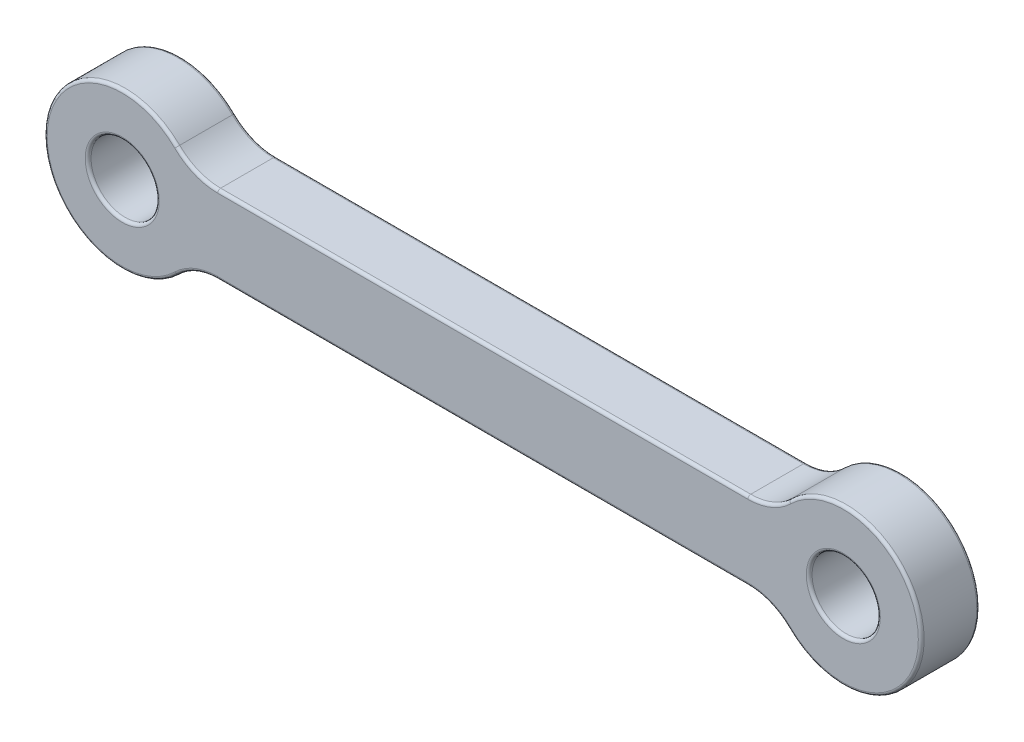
from build123d import *

# Parameters (mm, degrees)
SKETCH_1_R      = 4
SKETCH_1_R_2    = 1.75
EXTRUDE_1_DEPTH = 1.5
FILLET_1_R      = 3
FILLET_2_R      = 0.15


with BuildPart() as part:
    # Sketch 1 → Extrude 1 (new, symmetric)
    # profile 1 of 3: a face of its own
    with BuildSketch(Plane.XY):
        Circle(SKETCH_1_R)
        Circle(SKETCH_1_R_2, mode=Mode.SUBTRACT)
    # profile 2 of 3: a face of its own
    with BuildSketch(Plane.XY):
        with BuildLine():
            Line((3.464101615, -2), (33.535898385, -2))
            ThreePointArc((33.535898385, -2), (33, 0), (33.535898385, 2))
            Line((33.535898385, 2), (3.464101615, 2))
            ThreePointArc((3.464101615, 2), (3.863703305, 1.03527618), (4, 0))
            ThreePointArc((4, 0), (3.863703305, -1.03527618), (3.464101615, -2))
        make_face()
    # profile 3 of 3: a face of its own
    with BuildSketch(Plane.XY):
        with Locations((37, 0)):
            Circle(SKETCH_1_R)
        with Locations((37, 0)):
            Circle(SKETCH_1_R_2, mode=Mode.SUBTRACT)
    extrude(amount=EXTRUDE_1_DEPTH, both=True)

    # Fillet 1
    fillet_1_edges = [part.edges().sort_by_distance(p)[0] for p in [
        (3.464101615, 2, 0),
        (33.535898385, 2, 0),
        (33.535898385, -2, 0),
        (3.464101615, -2, 0),
    ]]
    fillet(fillet_1_edges, radius=FILLET_1_R)

    # Fillet 2
    fillet_2_edges = [part.edges().sort_by_distance(p)[0] for p in [
        (-1.75, 0, -1.5),
        (-4, 0, -1.5),
        (-4, 0, 1.5),
        (18.5, 2, -1.5),
        (18.5, 2, 1.5),
        (41, 0, -1.5),
        (41, 0, 1.5),
        (18.5, -2, -1.5),
        (18.5, -2, 1.5),
        (3.765086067, 2.222539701, -1.5),
        (35.25, 0, 1.5),
        (3.765086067, 2.222539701, 1.5),
        (33.234913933, 2.222539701, -1.5),
        (33.234913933, 2.222539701, 1.5),
        (3.765086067, -2.222539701, -1.5),
        (3.765086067, -2.222539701, 1.5),
        (33.234913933, -2.222539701, -1.5),
        (33.234913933, -2.222539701, 1.5),
        (-1.75, 0, 1.5),
        (35.25, 0, -1.5),
    ]]
    fillet(fillet_2_edges, radius=FILLET_2_R)


solid = part.part
